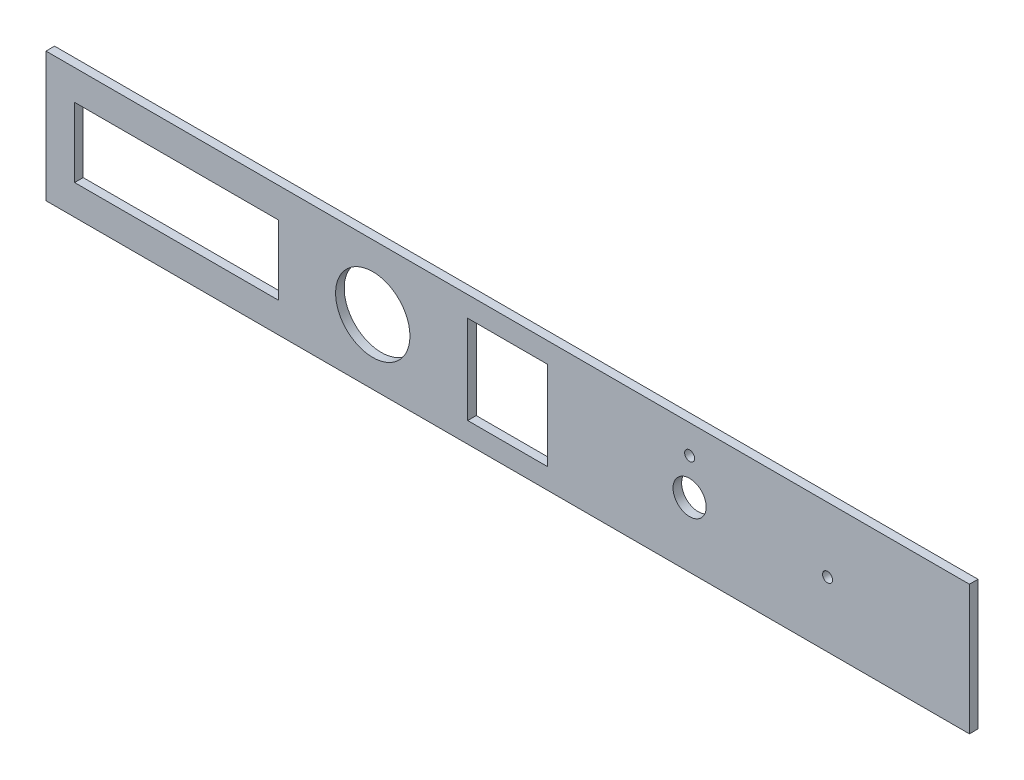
ISO-10303-21;
HEADER;
FILE_DESCRIPTION(('STEP AP214'),'2;1');
FILE_NAME('part.step','',(''),(''),'','','');
FILE_SCHEMA(('AUTOMOTIVE_DESIGN { 1 0 10303 214 1 1 1 1 }'));
ENDSEC;
DATA;
#1=APPLICATION_CONTEXT('core data for automotive mechanical design processes');
#2=APPLICATION_PROTOCOL_DEFINITION('international standard','automotive_design',2000,#1);
#3=PRODUCT_CONTEXT('',#1,'mechanical');
#4=PRODUCT('Part','Part','',(#3));
#5=PRODUCT_RELATED_PRODUCT_CATEGORY('part','',(#4));
#6=PRODUCT_DEFINITION_FORMATION('','',#4);
#7=PRODUCT_DEFINITION_CONTEXT('part definition',#1,'design');
#8=PRODUCT_DEFINITION('design','',#6,#7);
#9=PRODUCT_DEFINITION_SHAPE('','',#8);
#10=(LENGTH_UNIT() NAMED_UNIT(*) SI_UNIT(.MILLI.,.METRE.));
#11=(NAMED_UNIT(*) PLANE_ANGLE_UNIT() SI_UNIT($,.RADIAN.));
#12=(NAMED_UNIT(*) SI_UNIT($,.STERADIAN.) SOLID_ANGLE_UNIT());
#13=UNCERTAINTY_MEASURE_WITH_UNIT(LENGTH_MEASURE(1.E-05),#10,'distance_accuracy_value','');
#14=(GEOMETRIC_REPRESENTATION_CONTEXT(3) GLOBAL_UNCERTAINTY_ASSIGNED_CONTEXT((#13)) GLOBAL_UNIT_ASSIGNED_CONTEXT((#10,
#11,#12)) REPRESENTATION_CONTEXT('',''));
#15=CARTESIAN_POINT('',(0.,0.,0.));
#16=DIRECTION('',(0.,0.,1.));
#17=DIRECTION('',(1.,0.,0.));
#18=AXIS2_PLACEMENT_3D('',#15,#16,#17);
#19=CARTESIAN_POINT('',(161.5,22.67,3.));
#20=DIRECTION('',(-1.,0.,0.));
#21=DIRECTION('',(0.,0.,1.));
#22=AXIS2_PLACEMENT_3D('',#19,#20,#21);
#23=PLANE('',#22);
#24=DIRECTION('',(0.,1.,0.));
#25=VECTOR('',#24,1.);
#26=CARTESIAN_POINT('',(161.5,22.67,0.));
#27=LINE('',#26,#25);
#28=CARTESIAN_POINT('',(161.5,-22.67,0.));
#29=VERTEX_POINT('',#28);
#30=CARTESIAN_POINT('',(161.5,22.67,0.));
#31=VERTEX_POINT('',#30);
#32=EDGE_CURVE('E163',#29,#31,#27,.T.);
#33=ORIENTED_EDGE('',*,*,#32,.T.);
#34=DIRECTION('',(0.,0.,-1.));
#35=VECTOR('',#34,1.);
#36=CARTESIAN_POINT('',(161.5,22.67,3.));
#37=LINE('',#36,#35);
#38=CARTESIAN_POINT('',(161.5,22.67,3.));
#39=VERTEX_POINT('',#38);
#40=EDGE_CURVE('E11',#39,#31,#37,.T.);
#41=ORIENTED_EDGE('',*,*,#40,.F.);
#42=DIRECTION('',(0.,1.,0.));
#43=VECTOR('',#42,1.);
#44=CARTESIAN_POINT('',(161.5,22.67,3.));
#45=LINE('',#44,#43);
#46=CARTESIAN_POINT('',(161.5,-22.67,3.));
#47=VERTEX_POINT('',#46);
#48=EDGE_CURVE('E220',#47,#39,#45,.T.);
#49=ORIENTED_EDGE('',*,*,#48,.F.);
#50=DIRECTION('',(0.,0.,-1.));
#51=VECTOR('',#50,1.);
#52=CARTESIAN_POINT('',(161.5,-22.67,3.));
#53=LINE('',#52,#51);
#54=EDGE_CURVE('E230',#47,#29,#53,.T.);
#55=ORIENTED_EDGE('',*,*,#54,.T.);
#56=EDGE_LOOP('',(#33,#41,#49,#55));
#57=FACE_BOUND('',#56,.T.);
#58=ADVANCED_FACE('F38',(#57),#23,.F.);
#59=CARTESIAN_POINT('',(-161.5,22.67,3.));
#60=DIRECTION('',(0.,-1.,0.));
#61=DIRECTION('',(0.,0.,-1.));
#62=AXIS2_PLACEMENT_3D('',#59,#60,#61);
#63=PLANE('',#62);
#64=DIRECTION('',(-1.,0.,0.));
#65=VECTOR('',#64,1.);
#66=CARTESIAN_POINT('',(-161.5,22.67,0.));
#67=LINE('',#66,#65);
#68=CARTESIAN_POINT('',(-161.5,22.67,0.));
#69=VERTEX_POINT('',#68);
#70=EDGE_CURVE('E233',#31,#69,#67,.T.);
#71=ORIENTED_EDGE('',*,*,#70,.T.);
#72=DIRECTION('',(0.,0.,-1.));
#73=VECTOR('',#72,1.);
#74=CARTESIAN_POINT('',(-161.5,22.67,3.));
#75=LINE('',#74,#73);
#76=CARTESIAN_POINT('',(-161.5,22.67,3.));
#77=VERTEX_POINT('',#76);
#78=EDGE_CURVE('E45',#77,#69,#75,.T.);
#79=ORIENTED_EDGE('',*,*,#78,.F.);
#80=DIRECTION('',(-1.,0.,0.));
#81=VECTOR('',#80,1.);
#82=CARTESIAN_POINT('',(-161.5,22.67,3.));
#83=LINE('',#82,#81);
#84=EDGE_CURVE('E223',#39,#77,#83,.T.);
#85=ORIENTED_EDGE('',*,*,#84,.F.);
#86=ORIENTED_EDGE('',*,*,#40,.T.);
#87=EDGE_LOOP('',(#71,#79,#85,#86));
#88=FACE_BOUND('',#87,.T.);
#89=ADVANCED_FACE('F262',(#88),#63,.F.);
#90=CARTESIAN_POINT('',(-161.5,22.67,3.));
#91=DIRECTION('',(1.,0.,0.));
#92=DIRECTION('',(0.,0.,-1.));
#93=AXIS2_PLACEMENT_3D('',#90,#91,#92);
#94=PLANE('',#93);
#95=DIRECTION('',(0.,-1.,0.));
#96=VECTOR('',#95,1.);
#97=CARTESIAN_POINT('',(-161.5,22.67,0.));
#98=LINE('',#97,#96);
#99=CARTESIAN_POINT('',(-161.5,-22.67,0.));
#100=VERTEX_POINT('',#99);
#101=EDGE_CURVE('E235',#69,#100,#98,.T.);
#102=ORIENTED_EDGE('',*,*,#101,.T.);
#103=DIRECTION('',(0.,0.,-1.));
#104=VECTOR('',#103,1.);
#105=CARTESIAN_POINT('',(-161.5,-22.67,3.));
#106=LINE('',#105,#104);
#107=CARTESIAN_POINT('',(-161.5,-22.67,3.));
#108=VERTEX_POINT('',#107);
#109=EDGE_CURVE('E240',#108,#100,#106,.T.);
#110=ORIENTED_EDGE('',*,*,#109,.F.);
#111=DIRECTION('',(0.,-1.,0.));
#112=VECTOR('',#111,1.);
#113=CARTESIAN_POINT('',(-161.5,22.67,3.));
#114=LINE('',#113,#112);
#115=EDGE_CURVE('E226',#77,#108,#114,.T.);
#116=ORIENTED_EDGE('',*,*,#115,.F.);
#117=ORIENTED_EDGE('',*,*,#78,.T.);
#118=EDGE_LOOP('',(#102,#110,#116,#117));
#119=FACE_BOUND('',#118,.T.);
#120=ADVANCED_FACE('F247',(#119),#94,.F.);
#121=CARTESIAN_POINT('',(-161.5,-22.67,3.));
#122=DIRECTION('',(0.,1.,0.));
#123=DIRECTION('',(0.,0.,1.));
#124=AXIS2_PLACEMENT_3D('',#121,#122,#123);
#125=PLANE('',#124);
#126=DIRECTION('',(1.,0.,0.));
#127=VECTOR('',#126,1.);
#128=CARTESIAN_POINT('',(-161.5,-22.67,0.));
#129=LINE('',#128,#127);
#130=EDGE_CURVE('E224',#100,#29,#129,.T.);
#131=ORIENTED_EDGE('',*,*,#130,.T.);
#132=ORIENTED_EDGE('',*,*,#54,.F.);
#133=DIRECTION('',(1.,0.,0.));
#134=VECTOR('',#133,1.);
#135=CARTESIAN_POINT('',(-161.5,-22.67,3.));
#136=LINE('',#135,#134);
#137=EDGE_CURVE('E228',#108,#47,#136,.T.);
#138=ORIENTED_EDGE('',*,*,#137,.F.);
#139=ORIENTED_EDGE('',*,*,#109,.T.);
#140=EDGE_LOOP('',(#131,#132,#138,#139));
#141=FACE_BOUND('',#140,.T.);
#142=ADVANCED_FACE('F255',(#141),#125,.F.);
#143=CARTESIAN_POINT('',(0.,0.,3.));
#144=DIRECTION('',(0.,0.,1.));
#145=DIRECTION('',(1.,0.,0.));
#146=AXIS2_PLACEMENT_3D('',#143,#144,#145);
#147=PLANE('',#146);
#148=DIRECTION('',(0.,1.,0.));
#149=VECTOR('',#148,1.);
#150=CARTESIAN_POINT('',(-80.2,12.15,3.));
#151=LINE('',#150,#149);
#152=CARTESIAN_POINT('',(-80.2,-12.15,3.));
#153=VERTEX_POINT('',#152);
#154=CARTESIAN_POINT('',(-80.2,12.15,3.));
#155=VERTEX_POINT('',#154);
#156=EDGE_CURVE('E52',#153,#155,#151,.T.);
#157=ORIENTED_EDGE('',*,*,#156,.F.);
#158=DIRECTION('',(1.,0.,0.));
#159=VECTOR('',#158,1.);
#160=CARTESIAN_POINT('',(-151.5,-12.15,3.));
#161=LINE('',#160,#159);
#162=CARTESIAN_POINT('',(-151.5,-12.15,3.));
#163=VERTEX_POINT('',#162);
#164=EDGE_CURVE('E147',#163,#153,#161,.T.);
#165=ORIENTED_EDGE('',*,*,#164,.F.);
#166=DIRECTION('',(0.,-1.,0.));
#167=VECTOR('',#166,1.);
#168=CARTESIAN_POINT('',(-151.5,12.15,3.));
#169=LINE('',#168,#167);
#170=CARTESIAN_POINT('',(-151.5,12.15,3.));
#171=VERTEX_POINT('',#170);
#172=EDGE_CURVE('E150',#171,#163,#169,.T.);
#173=ORIENTED_EDGE('',*,*,#172,.F.);
#174=DIRECTION('',(-1.,0.,0.));
#175=VECTOR('',#174,1.);
#176=CARTESIAN_POINT('',(-151.5,12.15,3.));
#177=LINE('',#176,#175);
#178=EDGE_CURVE('E156',#155,#171,#177,.T.);
#179=ORIENTED_EDGE('',*,*,#178,.F.);
#180=EDGE_LOOP('',(#157,#165,#173,#179));
#181=FACE_BOUND('',#180,.T.);
#182=DIRECTION('',(0.,1.,0.));
#183=VECTOR('',#182,1.);
#184=CARTESIAN_POINT('',(14.,15.5,3.));
#185=LINE('',#184,#183);
#186=CARTESIAN_POINT('',(14.,-15.5,3.));
#187=VERTEX_POINT('',#186);
#188=CARTESIAN_POINT('',(14.,15.5,3.));
#189=VERTEX_POINT('',#188);
#190=EDGE_CURVE('E60',#187,#189,#185,.T.);
#191=ORIENTED_EDGE('',*,*,#190,.F.);
#192=DIRECTION('',(1.,0.,0.));
#193=VECTOR('',#192,1.);
#194=CARTESIAN_POINT('',(-14.,-15.5,3.));
#195=LINE('',#194,#193);
#196=CARTESIAN_POINT('',(-14.,-15.5,3.));
#197=VERTEX_POINT('',#196);
#198=EDGE_CURVE('E176',#197,#187,#195,.T.);
#199=ORIENTED_EDGE('',*,*,#198,.F.);
#200=DIRECTION('',(0.,-1.,0.));
#201=VECTOR('',#200,1.);
#202=CARTESIAN_POINT('',(-14.,15.5,3.));
#203=LINE('',#202,#201);
#204=CARTESIAN_POINT('',(-14.,15.5,3.));
#205=VERTEX_POINT('',#204);
#206=EDGE_CURVE('E179',#205,#197,#203,.T.);
#207=ORIENTED_EDGE('',*,*,#206,.F.);
#208=DIRECTION('',(-1.,0.,0.));
#209=VECTOR('',#208,1.);
#210=CARTESIAN_POINT('',(-14.,15.5,3.));
#211=LINE('',#210,#209);
#212=EDGE_CURVE('E183',#189,#205,#211,.T.);
#213=ORIENTED_EDGE('',*,*,#212,.F.);
#214=EDGE_LOOP('',(#191,#199,#207,#213));
#215=FACE_BOUND('',#214,.T.);
#216=CARTESIAN_POINT('',(-47.2,0.,3.));
#217=DIRECTION('',(0.,0.,1.));
#218=DIRECTION('',(1.,0.,0.));
#219=AXIS2_PLACEMENT_3D('',#216,#217,#218);
#220=CIRCLE('',#219,13.);
#221=CARTESIAN_POINT('',(-34.2,0.,3.));
#222=VERTEX_POINT('',#221);
#223=EDGE_CURVE('E157',#222,#222,#220,.T.);
#224=ORIENTED_EDGE('',*,*,#223,.F.);
#225=EDGE_LOOP('',(#224));
#226=FACE_BOUND('',#225,.T.);
#227=CARTESIAN_POINT('',(63.625,0.,3.));
#228=DIRECTION('',(0.,0.,1.));
#229=DIRECTION('',(1.,0.,0.));
#230=AXIS2_PLACEMENT_3D('',#227,#228,#229);
#231=CIRCLE('',#230,5.79999999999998);
#232=CARTESIAN_POINT('',(69.425,0.,3.));
#233=VERTEX_POINT('',#232);
#234=EDGE_CURVE('E215',#233,#233,#231,.T.);
#235=ORIENTED_EDGE('',*,*,#234,.F.);
#236=EDGE_LOOP('',(#235));
#237=FACE_BOUND('',#236,.T.);
#238=CARTESIAN_POINT('',(63.625,12.67,3.));
#239=DIRECTION('',(0.,0.,1.));
#240=DIRECTION('',(1.,0.,0.));
#241=AXIS2_PLACEMENT_3D('',#238,#239,#240);
#242=CIRCLE('',#241,1.75);
#243=CARTESIAN_POINT('',(65.375,12.67,3.));
#244=VERTEX_POINT('',#243);
#245=EDGE_CURVE('E198',#244,#244,#242,.T.);
#246=ORIENTED_EDGE('',*,*,#245,.F.);
#247=EDGE_LOOP('',(#246));
#248=FACE_BOUND('',#247,.T.);
#249=CARTESIAN_POINT('',(111.875,0.,3.));
#250=DIRECTION('',(0.,0.,1.));
#251=DIRECTION('',(1.,0.,0.));
#252=AXIS2_PLACEMENT_3D('',#249,#250,#251);
#253=CIRCLE('',#252,1.75);
#254=CARTESIAN_POINT('',(113.625,0.,3.));
#255=VERTEX_POINT('',#254);
#256=EDGE_CURVE('E205',#255,#255,#253,.T.);
#257=ORIENTED_EDGE('',*,*,#256,.F.);
#258=EDGE_LOOP('',(#257));
#259=FACE_BOUND('',#258,.T.);
#260=ORIENTED_EDGE('',*,*,#48,.T.);
#261=ORIENTED_EDGE('',*,*,#84,.T.);
#262=ORIENTED_EDGE('',*,*,#115,.T.);
#263=ORIENTED_EDGE('',*,*,#137,.T.);
#264=EDGE_LOOP('',(#260,#261,#262,#263));
#265=FACE_BOUND('',#264,.T.);
#266=ADVANCED_FACE('F261',(#181,#215,#226,#237,#248,#259,#265),#147,.T.);
#267=CARTESIAN_POINT('',(0.,0.,0.));
#268=DIRECTION('',(0.,0.,1.));
#269=DIRECTION('',(1.,0.,0.));
#270=AXIS2_PLACEMENT_3D('',#267,#268,#269);
#271=PLANE('',#270);
#272=DIRECTION('',(1.,0.,0.));
#273=VECTOR('',#272,1.);
#274=CARTESIAN_POINT('',(-151.5,-12.15,0.));
#275=LINE('',#274,#273);
#276=CARTESIAN_POINT('',(-151.5,-12.15,0.));
#277=VERTEX_POINT('',#276);
#278=CARTESIAN_POINT('',(-80.2,-12.15,0.));
#279=VERTEX_POINT('',#278);
#280=EDGE_CURVE('E134',#277,#279,#275,.T.);
#281=ORIENTED_EDGE('',*,*,#280,.T.);
#282=DIRECTION('',(0.,1.,0.));
#283=VECTOR('',#282,1.);
#284=CARTESIAN_POINT('',(-80.2,12.15,0.));
#285=LINE('',#284,#283);
#286=CARTESIAN_POINT('',(-80.2,12.15,0.));
#287=VERTEX_POINT('',#286);
#288=EDGE_CURVE('E128',#279,#287,#285,.T.);
#289=ORIENTED_EDGE('',*,*,#288,.T.);
#290=DIRECTION('',(-1.,0.,0.));
#291=VECTOR('',#290,1.);
#292=CARTESIAN_POINT('',(-151.5,12.15,0.));
#293=LINE('',#292,#291);
#294=CARTESIAN_POINT('',(-151.5,12.15,0.));
#295=VERTEX_POINT('',#294);
#296=EDGE_CURVE('E138',#287,#295,#293,.T.);
#297=ORIENTED_EDGE('',*,*,#296,.T.);
#298=DIRECTION('',(0.,-1.,0.));
#299=VECTOR('',#298,1.);
#300=CARTESIAN_POINT('',(-151.5,12.15,0.));
#301=LINE('',#300,#299);
#302=EDGE_CURVE('E142',#295,#277,#301,.T.);
#303=ORIENTED_EDGE('',*,*,#302,.T.);
#304=EDGE_LOOP('',(#281,#289,#297,#303));
#305=FACE_BOUND('',#304,.T.);
#306=DIRECTION('',(1.,0.,0.));
#307=VECTOR('',#306,1.);
#308=CARTESIAN_POINT('',(-14.,-15.5,0.));
#309=LINE('',#308,#307);
#310=CARTESIAN_POINT('',(-14.,-15.5,0.));
#311=VERTEX_POINT('',#310);
#312=CARTESIAN_POINT('',(14.,-15.5,0.));
#313=VERTEX_POINT('',#312);
#314=EDGE_CURVE('E169',#311,#313,#309,.T.);
#315=ORIENTED_EDGE('',*,*,#314,.T.);
#316=DIRECTION('',(0.,1.,0.));
#317=VECTOR('',#316,1.);
#318=CARTESIAN_POINT('',(14.,15.5,0.));
#319=LINE('',#318,#317);
#320=CARTESIAN_POINT('',(14.,15.5,0.));
#321=VERTEX_POINT('',#320);
#322=EDGE_CURVE('E180',#313,#321,#319,.T.);
#323=ORIENTED_EDGE('',*,*,#322,.T.);
#324=DIRECTION('',(-1.,0.,0.));
#325=VECTOR('',#324,1.);
#326=CARTESIAN_POINT('',(-14.,15.5,0.));
#327=LINE('',#326,#325);
#328=CARTESIAN_POINT('',(-14.,15.5,0.));
#329=VERTEX_POINT('',#328);
#330=EDGE_CURVE('E193',#321,#329,#327,.T.);
#331=ORIENTED_EDGE('',*,*,#330,.T.);
#332=DIRECTION('',(0.,-1.,0.));
#333=VECTOR('',#332,1.);
#334=CARTESIAN_POINT('',(-14.,15.5,0.));
#335=LINE('',#334,#333);
#336=EDGE_CURVE('E190',#329,#311,#335,.T.);
#337=ORIENTED_EDGE('',*,*,#336,.T.);
#338=EDGE_LOOP('',(#315,#323,#331,#337));
#339=FACE_BOUND('',#338,.T.);
#340=CARTESIAN_POINT('',(-47.2,0.,0.));
#341=DIRECTION('',(0.,0.,1.));
#342=DIRECTION('',(1.,0.,0.));
#343=AXIS2_PLACEMENT_3D('',#340,#341,#342);
#344=CIRCLE('',#343,13.);
#345=CARTESIAN_POINT('',(-34.2,0.,0.));
#346=VERTEX_POINT('',#345);
#347=EDGE_CURVE('E212',#346,#346,#344,.T.);
#348=ORIENTED_EDGE('',*,*,#347,.T.);
#349=EDGE_LOOP('',(#348));
#350=FACE_BOUND('',#349,.T.);
#351=CARTESIAN_POINT('',(63.625,0.,0.));
#352=DIRECTION('',(0.,0.,1.));
#353=DIRECTION('',(1.,0.,0.));
#354=AXIS2_PLACEMENT_3D('',#351,#352,#353);
#355=CIRCLE('',#354,5.79999999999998);
#356=CARTESIAN_POINT('',(69.425,0.,0.));
#357=VERTEX_POINT('',#356);
#358=EDGE_CURVE('E201',#357,#357,#355,.T.);
#359=ORIENTED_EDGE('',*,*,#358,.T.);
#360=EDGE_LOOP('',(#359));
#361=FACE_BOUND('',#360,.T.);
#362=CARTESIAN_POINT('',(63.625,12.67,0.));
#363=DIRECTION('',(0.,0.,1.));
#364=DIRECTION('',(1.,0.,0.));
#365=AXIS2_PLACEMENT_3D('',#362,#363,#364);
#366=CIRCLE('',#365,1.75);
#367=CARTESIAN_POINT('',(65.375,12.67,0.));
#368=VERTEX_POINT('',#367);
#369=EDGE_CURVE('E202',#368,#368,#366,.T.);
#370=ORIENTED_EDGE('',*,*,#369,.T.);
#371=EDGE_LOOP('',(#370));
#372=FACE_BOUND('',#371,.T.);
#373=CARTESIAN_POINT('',(111.875,0.,0.));
#374=DIRECTION('',(0.,0.,1.));
#375=DIRECTION('',(1.,0.,0.));
#376=AXIS2_PLACEMENT_3D('',#373,#374,#375);
#377=CIRCLE('',#376,1.75);
#378=CARTESIAN_POINT('',(113.625,0.,0.));
#379=VERTEX_POINT('',#378);
#380=EDGE_CURVE('E187',#379,#379,#377,.T.);
#381=ORIENTED_EDGE('',*,*,#380,.T.);
#382=EDGE_LOOP('',(#381));
#383=FACE_BOUND('',#382,.T.);
#384=ORIENTED_EDGE('',*,*,#32,.F.);
#385=ORIENTED_EDGE('',*,*,#130,.F.);
#386=ORIENTED_EDGE('',*,*,#101,.F.);
#387=ORIENTED_EDGE('',*,*,#70,.F.);
#388=EDGE_LOOP('',(#384,#385,#386,#387));
#389=FACE_BOUND('',#388,.T.);
#390=ADVANCED_FACE('F144',(#305,#339,#350,#361,#372,#383,#389),#271,.F.);
#391=CARTESIAN_POINT('',(111.875,0.,0.));
#392=DIRECTION('',(0.,0.,1.));
#393=DIRECTION('',(1.,0.,0.));
#394=AXIS2_PLACEMENT_3D('',#391,#392,#393);
#395=CYLINDRICAL_SURFACE('',#394,1.75);
#396=ORIENTED_EDGE('',*,*,#380,.F.);
#397=EDGE_LOOP('',(#396));
#398=FACE_BOUND('',#397,.T.);
#399=ORIENTED_EDGE('',*,*,#256,.T.);
#400=EDGE_LOOP('',(#399));
#401=FACE_BOUND('',#400,.T.);
#402=ADVANCED_FACE('F274',(#398,#401),#395,.F.);
#403=CARTESIAN_POINT('',(63.625,12.67,0.));
#404=DIRECTION('',(0.,0.,1.));
#405=DIRECTION('',(1.,0.,0.));
#406=AXIS2_PLACEMENT_3D('',#403,#404,#405);
#407=CYLINDRICAL_SURFACE('',#406,1.75);
#408=ORIENTED_EDGE('',*,*,#369,.F.);
#409=EDGE_LOOP('',(#408));
#410=FACE_BOUND('',#409,.T.);
#411=ORIENTED_EDGE('',*,*,#245,.T.);
#412=EDGE_LOOP('',(#411));
#413=FACE_BOUND('',#412,.T.);
#414=ADVANCED_FACE('F282',(#410,#413),#407,.F.);
#415=CARTESIAN_POINT('',(63.625,0.,0.));
#416=DIRECTION('',(0.,0.,1.));
#417=DIRECTION('',(1.,0.,0.));
#418=AXIS2_PLACEMENT_3D('',#415,#416,#417);
#419=CYLINDRICAL_SURFACE('',#418,5.79999999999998);
#420=ORIENTED_EDGE('',*,*,#358,.F.);
#421=EDGE_LOOP('',(#420));
#422=FACE_BOUND('',#421,.T.);
#423=ORIENTED_EDGE('',*,*,#234,.T.);
#424=EDGE_LOOP('',(#423));
#425=FACE_BOUND('',#424,.T.);
#426=ADVANCED_FACE('F278',(#422,#425),#419,.F.);
#427=CARTESIAN_POINT('',(-47.2,0.,0.));
#428=DIRECTION('',(0.,0.,1.));
#429=DIRECTION('',(1.,0.,0.));
#430=AXIS2_PLACEMENT_3D('',#427,#428,#429);
#431=CYLINDRICAL_SURFACE('',#430,13.);
#432=ORIENTED_EDGE('',*,*,#347,.F.);
#433=EDGE_LOOP('',(#432));
#434=FACE_BOUND('',#433,.T.);
#435=ORIENTED_EDGE('',*,*,#223,.T.);
#436=EDGE_LOOP('',(#435));
#437=FACE_BOUND('',#436,.T.);
#438=ADVANCED_FACE('F281',(#434,#437),#431,.F.);
#439=CARTESIAN_POINT('',(14.,15.5,0.));
#440=DIRECTION('',(1.,0.,0.));
#441=DIRECTION('',(0.,1.,0.));
#442=AXIS2_PLACEMENT_3D('',#439,#440,#441);
#443=PLANE('',#442);
#444=ORIENTED_EDGE('',*,*,#190,.T.);
#445=DIRECTION('',(0.,0.,1.));
#446=VECTOR('',#445,1.);
#447=CARTESIAN_POINT('',(14.,15.5,0.));
#448=LINE('',#447,#446);
#449=EDGE_CURVE('E167',#321,#189,#448,.T.);
#450=ORIENTED_EDGE('',*,*,#449,.F.);
#451=ORIENTED_EDGE('',*,*,#322,.F.);
#452=DIRECTION('',(0.,0.,1.));
#453=VECTOR('',#452,1.);
#454=CARTESIAN_POINT('',(14.,-15.5,0.));
#455=LINE('',#454,#453);
#456=EDGE_CURVE('E174',#313,#187,#455,.T.);
#457=ORIENTED_EDGE('',*,*,#456,.T.);
#458=EDGE_LOOP('',(#444,#450,#451,#457));
#459=FACE_BOUND('',#458,.T.);
#460=ADVANCED_FACE('F286',(#459),#443,.F.);
#461=CARTESIAN_POINT('',(-14.,-15.5,0.));
#462=DIRECTION('',(0.,-1.,0.));
#463=DIRECTION('',(0.,0.,-1.));
#464=AXIS2_PLACEMENT_3D('',#461,#462,#463);
#465=PLANE('',#464);
#466=ORIENTED_EDGE('',*,*,#198,.T.);
#467=ORIENTED_EDGE('',*,*,#456,.F.);
#468=ORIENTED_EDGE('',*,*,#314,.F.);
#469=DIRECTION('',(0.,0.,1.));
#470=VECTOR('',#469,1.);
#471=CARTESIAN_POINT('',(-14.,-15.5,0.));
#472=LINE('',#471,#470);
#473=EDGE_CURVE('E172',#311,#197,#472,.T.);
#474=ORIENTED_EDGE('',*,*,#473,.T.);
#475=EDGE_LOOP('',(#466,#467,#468,#474));
#476=FACE_BOUND('',#475,.T.);
#477=ADVANCED_FACE('F294',(#476),#465,.F.);
#478=CARTESIAN_POINT('',(-14.,15.5,0.));
#479=DIRECTION('',(-1.,0.,0.));
#480=DIRECTION('',(0.,-1.,0.));
#481=AXIS2_PLACEMENT_3D('',#478,#479,#480);
#482=PLANE('',#481);
#483=ORIENTED_EDGE('',*,*,#206,.T.);
#484=ORIENTED_EDGE('',*,*,#473,.F.);
#485=ORIENTED_EDGE('',*,*,#336,.F.);
#486=DIRECTION('',(0.,0.,1.));
#487=VECTOR('',#486,1.);
#488=CARTESIAN_POINT('',(-14.,15.5,0.));
#489=LINE('',#488,#487);
#490=EDGE_CURVE('E170',#329,#205,#489,.T.);
#491=ORIENTED_EDGE('',*,*,#490,.T.);
#492=EDGE_LOOP('',(#483,#484,#485,#491));
#493=FACE_BOUND('',#492,.T.);
#494=ADVANCED_FACE('F297',(#493),#482,.F.);
#495=CARTESIAN_POINT('',(-14.,15.5,0.));
#496=DIRECTION('',(0.,1.,0.));
#497=DIRECTION('',(0.,0.,1.));
#498=AXIS2_PLACEMENT_3D('',#495,#496,#497);
#499=PLANE('',#498);
#500=ORIENTED_EDGE('',*,*,#212,.T.);
#501=ORIENTED_EDGE('',*,*,#490,.F.);
#502=ORIENTED_EDGE('',*,*,#330,.F.);
#503=ORIENTED_EDGE('',*,*,#449,.T.);
#504=EDGE_LOOP('',(#500,#501,#502,#503));
#505=FACE_BOUND('',#504,.T.);
#506=ADVANCED_FACE('F301',(#505),#499,.F.);
#507=CARTESIAN_POINT('',(-80.2,12.15,0.));
#508=DIRECTION('',(1.,0.,0.));
#509=DIRECTION('',(0.,0.,-1.));
#510=AXIS2_PLACEMENT_3D('',#507,#508,#509);
#511=PLANE('',#510);
#512=ORIENTED_EDGE('',*,*,#156,.T.);
#513=DIRECTION('',(0.,0.,1.));
#514=VECTOR('',#513,1.);
#515=CARTESIAN_POINT('',(-80.2,12.15,0.));
#516=LINE('',#515,#514);
#517=EDGE_CURVE('E124',#287,#155,#516,.T.);
#518=ORIENTED_EDGE('',*,*,#517,.F.);
#519=ORIENTED_EDGE('',*,*,#288,.F.);
#520=DIRECTION('',(0.,0.,1.));
#521=VECTOR('',#520,1.);
#522=CARTESIAN_POINT('',(-80.2,-12.15,0.));
#523=LINE('',#522,#521);
#524=EDGE_CURVE('E161',#279,#153,#523,.T.);
#525=ORIENTED_EDGE('',*,*,#524,.T.);
#526=EDGE_LOOP('',(#512,#518,#519,#525));
#527=FACE_BOUND('',#526,.T.);
#528=ADVANCED_FACE('F126',(#527),#511,.F.);
#529=CARTESIAN_POINT('',(-151.5,-12.15,0.));
#530=DIRECTION('',(0.,-1.,0.));
#531=DIRECTION('',(1.,0.,0.));
#532=AXIS2_PLACEMENT_3D('',#529,#530,#531);
#533=PLANE('',#532);
#534=ORIENTED_EDGE('',*,*,#164,.T.);
#535=ORIENTED_EDGE('',*,*,#524,.F.);
#536=ORIENTED_EDGE('',*,*,#280,.F.);
#537=DIRECTION('',(0.,0.,1.));
#538=VECTOR('',#537,1.);
#539=CARTESIAN_POINT('',(-151.5,-12.15,0.));
#540=LINE('',#539,#538);
#541=EDGE_CURVE('E164',#277,#163,#540,.T.);
#542=ORIENTED_EDGE('',*,*,#541,.T.);
#543=EDGE_LOOP('',(#534,#535,#536,#542));
#544=FACE_BOUND('',#543,.T.);
#545=ADVANCED_FACE('F310',(#544),#533,.F.);
#546=CARTESIAN_POINT('',(-151.5,12.15,0.));
#547=DIRECTION('',(-1.,0.,0.));
#548=DIRECTION('',(0.,0.,1.));
#549=AXIS2_PLACEMENT_3D('',#546,#547,#548);
#550=PLANE('',#549);
#551=ORIENTED_EDGE('',*,*,#172,.T.);
#552=ORIENTED_EDGE('',*,*,#541,.F.);
#553=ORIENTED_EDGE('',*,*,#302,.F.);
#554=DIRECTION('',(0.,0.,1.));
#555=VECTOR('',#554,1.);
#556=CARTESIAN_POINT('',(-151.5,12.15,0.));
#557=LINE('',#556,#555);
#558=EDGE_CURVE('E133',#295,#171,#557,.T.);
#559=ORIENTED_EDGE('',*,*,#558,.T.);
#560=EDGE_LOOP('',(#551,#552,#553,#559));
#561=FACE_BOUND('',#560,.T.);
#562=ADVANCED_FACE('F313',(#561),#550,.F.);
#563=CARTESIAN_POINT('',(-151.5,12.15,0.));
#564=DIRECTION('',(0.,1.,0.));
#565=DIRECTION('',(-1.,0.,0.));
#566=AXIS2_PLACEMENT_3D('',#563,#564,#565);
#567=PLANE('',#566);
#568=ORIENTED_EDGE('',*,*,#178,.T.);
#569=ORIENTED_EDGE('',*,*,#558,.F.);
#570=ORIENTED_EDGE('',*,*,#296,.F.);
#571=ORIENTED_EDGE('',*,*,#517,.T.);
#572=EDGE_LOOP('',(#568,#569,#570,#571));
#573=FACE_BOUND('',#572,.T.);
#574=ADVANCED_FACE('F139',(#573),#567,.F.);
#575=CLOSED_SHELL('',(#58,#89,#120,#142,#266,#390,#402,#414,#426,#438,#460,#477,#494,#506,#528,
#545,#562,#574));
#576=MANIFOLD_SOLID_BREP('B2',#575);
#577=ADVANCED_BREP_SHAPE_REPRESENTATION('',(#18,#576),#14);
#578=SHAPE_DEFINITION_REPRESENTATION(#9,#577);
ENDSEC;
END-ISO-10303-21;
